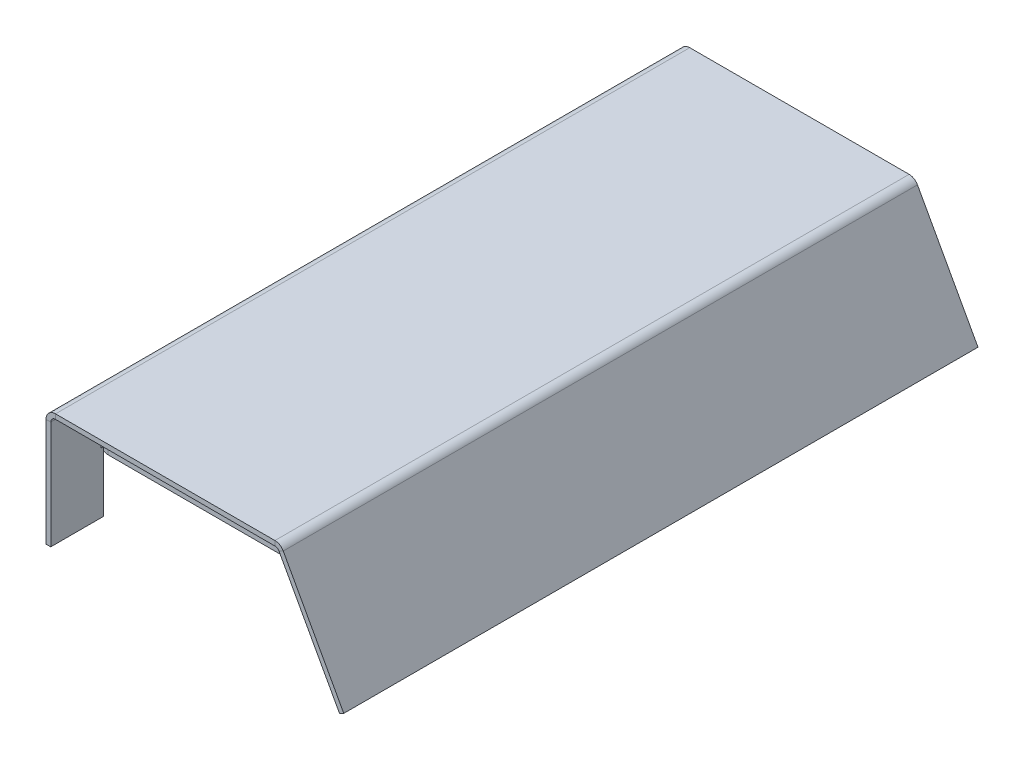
ISO-10303-21;
HEADER;
FILE_DESCRIPTION(('STEP AP214'),'2;1');
FILE_NAME('part.step','',(''),(''),'','','');
FILE_SCHEMA(('AUTOMOTIVE_DESIGN { 1 0 10303 214 1 1 1 1 }'));
ENDSEC;
DATA;
#1=APPLICATION_CONTEXT('core data for automotive mechanical design processes');
#2=APPLICATION_PROTOCOL_DEFINITION('international standard','automotive_design',2000,#1);
#3=PRODUCT_CONTEXT('',#1,'mechanical');
#4=PRODUCT('Part','Part','',(#3));
#5=PRODUCT_RELATED_PRODUCT_CATEGORY('part','',(#4));
#6=PRODUCT_DEFINITION_FORMATION('','',#4);
#7=PRODUCT_DEFINITION_CONTEXT('part definition',#1,'design');
#8=PRODUCT_DEFINITION('design','',#6,#7);
#9=PRODUCT_DEFINITION_SHAPE('','',#8);
#10=(LENGTH_UNIT() NAMED_UNIT(*) SI_UNIT(.MILLI.,.METRE.));
#11=(NAMED_UNIT(*) PLANE_ANGLE_UNIT() SI_UNIT($,.RADIAN.));
#12=(NAMED_UNIT(*) SI_UNIT($,.STERADIAN.) SOLID_ANGLE_UNIT());
#13=UNCERTAINTY_MEASURE_WITH_UNIT(LENGTH_MEASURE(1.E-05),#10,'distance_accuracy_value','');
#14=(GEOMETRIC_REPRESENTATION_CONTEXT(3) GLOBAL_UNCERTAINTY_ASSIGNED_CONTEXT((#13)) GLOBAL_UNIT_ASSIGNED_CONTEXT((#10,
#11,#12)) REPRESENTATION_CONTEXT('',''));
#15=CARTESIAN_POINT('',(0.,0.,0.));
#16=DIRECTION('',(0.,0.,1.));
#17=DIRECTION('',(1.,0.,0.));
#18=AXIS2_PLACEMENT_3D('',#15,#16,#17);
#19=CARTESIAN_POINT('',(-89.5814787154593,20.577072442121,183.41064428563));
#20=DIRECTION('',(0.,0.,1.));
#21=DIRECTION('',(1.,0.,0.));
#22=AXIS2_PLACEMENT_3D('',#19,#20,#21);
#23=PLANE('',#22);
#24=DIRECTION('',(0.,-1.,0.));
#25=VECTOR('',#24,1.);
#26=CARTESIAN_POINT('',(-89.5814787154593,19.077072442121,183.41064428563));
#27=LINE('',#26,#25);
#28=CARTESIAN_POINT('',(-89.5814787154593,19.077072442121,183.41064428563));
#29=VERTEX_POINT('',#28);
#30=CARTESIAN_POINT('',(-89.5814787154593,17.577072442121,183.41064428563));
#31=VERTEX_POINT('',#30);
#32=EDGE_CURVE('E835',#29,#31,#27,.T.);
#33=ORIENTED_EDGE('',*,*,#32,.F.);
#34=CARTESIAN_POINT('',(-89.5814787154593,20.577072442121,183.41064428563));
#35=DIRECTION('',(0.,0.,-1.));
#36=DIRECTION('',(-1.,0.,0.));
#37=AXIS2_PLACEMENT_3D('',#34,#35,#36);
#38=CIRCLE('',#37,1.49999999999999);
#39=CARTESIAN_POINT('',(-91.0814787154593,20.577072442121,183.41064428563));
#40=VERTEX_POINT('',#39);
#41=EDGE_CURVE('E802',#40,#29,#38,.F.);
#42=ORIENTED_EDGE('',*,*,#41,.F.);
#43=DIRECTION('',(-1.,0.,0.));
#44=VECTOR('',#43,1.);
#45=CARTESIAN_POINT('',(-91.0814787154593,20.577072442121,183.41064428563));
#46=LINE('',#45,#44);
#47=CARTESIAN_POINT('',(-92.5814787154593,20.577072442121,183.41064428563));
#48=VERTEX_POINT('',#47);
#49=EDGE_CURVE('E11',#40,#48,#46,.T.);
#50=ORIENTED_EDGE('',*,*,#49,.T.);
#51=CARTESIAN_POINT('',(-89.5814787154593,20.577072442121,183.41064428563));
#52=DIRECTION('',(0.,0.,-1.));
#53=DIRECTION('',(-1.,0.,0.));
#54=AXIS2_PLACEMENT_3D('',#51,#52,#53);
#55=CIRCLE('',#54,2.99999999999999);
#56=EDGE_CURVE('E811',#48,#31,#55,.F.);
#57=ORIENTED_EDGE('',*,*,#56,.T.);
#58=EDGE_LOOP('',(#33,#42,#50,#57));
#59=FACE_BOUND('',#58,.T.);
#60=ADVANCED_FACE('F374',(#59),#23,.T.);
#61=CARTESIAN_POINT('',(-89.5814787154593,20.577072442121,28.0181228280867));
#62=DIRECTION('',(0.,0.,1.));
#63=DIRECTION('',(1.,0.,0.));
#64=AXIS2_PLACEMENT_3D('',#61,#62,#63);
#65=PLANE('',#64);
#66=CARTESIAN_POINT('',(-89.5814787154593,20.577072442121,28.0181228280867));
#67=DIRECTION('',(0.,0.,-1.));
#68=DIRECTION('',(-1.,0.,0.));
#69=AXIS2_PLACEMENT_3D('',#66,#67,#68);
#70=CIRCLE('',#69,1.49999999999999);
#71=CARTESIAN_POINT('',(-89.5814787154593,19.077072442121,28.0181228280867));
#72=VERTEX_POINT('',#71);
#73=CARTESIAN_POINT('',(-91.0814787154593,20.577072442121,28.0181228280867));
#74=VERTEX_POINT('',#73);
#75=EDGE_CURVE('E801',#72,#74,#70,.T.);
#76=ORIENTED_EDGE('',*,*,#75,.F.);
#77=DIRECTION('',(0.,-1.,0.));
#78=VECTOR('',#77,1.);
#79=CARTESIAN_POINT('',(-89.5814787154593,19.077072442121,28.0181228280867));
#80=LINE('',#79,#78);
#81=CARTESIAN_POINT('',(-89.5814787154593,17.577072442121,28.0181228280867));
#82=VERTEX_POINT('',#81);
#83=EDGE_CURVE('E819',#72,#82,#80,.T.);
#84=ORIENTED_EDGE('',*,*,#83,.T.);
#85=CARTESIAN_POINT('',(-89.5814787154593,20.577072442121,28.0181228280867));
#86=DIRECTION('',(0.,0.,-1.));
#87=DIRECTION('',(-1.,0.,0.));
#88=AXIS2_PLACEMENT_3D('',#85,#86,#87);
#89=CIRCLE('',#88,2.99999999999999);
#90=CARTESIAN_POINT('',(-92.5814787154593,20.577072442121,28.0181228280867));
#91=VERTEX_POINT('',#90);
#92=EDGE_CURVE('E805',#82,#91,#89,.T.);
#93=ORIENTED_EDGE('',*,*,#92,.T.);
#94=DIRECTION('',(-1.,0.,0.));
#95=VECTOR('',#94,1.);
#96=CARTESIAN_POINT('',(-91.0814787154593,20.577072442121,28.0181228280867));
#97=LINE('',#96,#95);
#98=EDGE_CURVE('E378',#74,#91,#97,.T.);
#99=ORIENTED_EDGE('',*,*,#98,.F.);
#100=EDGE_LOOP('',(#76,#84,#93,#99));
#101=FACE_BOUND('',#100,.T.);
#102=ADVANCED_FACE('F376',(#101),#65,.F.);
#103=CARTESIAN_POINT('',(-89.5814787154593,20.577072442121,28.0181228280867));
#104=DIRECTION('',(0.,0.,-1.));
#105=DIRECTION('',(0.,-1.,0.));
#106=AXIS2_PLACEMENT_3D('',#103,#104,#105);
#107=CYLINDRICAL_SURFACE('',#106,2.99999999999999);
#108=DIRECTION('',(0.,0.,-1.));
#109=VECTOR('',#108,1.);
#110=CARTESIAN_POINT('',(-92.5814787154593,20.577072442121,28.0181228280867));
#111=LINE('',#110,#109);
#112=EDGE_CURVE('E389',#91,#48,#111,.F.);
#113=ORIENTED_EDGE('',*,*,#112,.F.);
#114=ORIENTED_EDGE('',*,*,#92,.F.);
#115=DIRECTION('',(0.,0.,-1.));
#116=VECTOR('',#115,1.);
#117=CARTESIAN_POINT('',(-89.5814787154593,17.577072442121,28.0181228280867));
#118=LINE('',#117,#116);
#119=EDGE_CURVE('E394',#31,#82,#118,.T.);
#120=ORIENTED_EDGE('',*,*,#119,.F.);
#121=ORIENTED_EDGE('',*,*,#56,.F.);
#122=EDGE_LOOP('',(#113,#114,#120,#121));
#123=FACE_BOUND('',#122,.T.);
#124=ADVANCED_FACE('F858',(#123),#107,.T.);
#125=CARTESIAN_POINT('',(-89.5814787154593,20.577072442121,28.0181228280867));
#126=DIRECTION('',(0.,0.,-1.));
#127=DIRECTION('',(0.,-1.,0.));
#128=AXIS2_PLACEMENT_3D('',#125,#126,#127);
#129=CYLINDRICAL_SURFACE('',#128,1.49999999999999);
#130=DIRECTION('',(0.,0.,-1.));
#131=VECTOR('',#130,1.);
#132=CARTESIAN_POINT('',(-91.0814787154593,20.577072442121,28.0181228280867));
#133=LINE('',#132,#131);
#134=EDGE_CURVE('E806',#74,#40,#133,.F.);
#135=ORIENTED_EDGE('',*,*,#134,.T.);
#136=ORIENTED_EDGE('',*,*,#41,.T.);
#137=DIRECTION('',(0.,0.,-1.));
#138=VECTOR('',#137,1.);
#139=CARTESIAN_POINT('',(-89.5814787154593,19.077072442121,183.41064428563));
#140=LINE('',#139,#138);
#141=EDGE_CURVE('E566',#29,#72,#140,.T.);
#142=ORIENTED_EDGE('',*,*,#141,.T.);
#143=ORIENTED_EDGE('',*,*,#75,.T.);
#144=EDGE_LOOP('',(#135,#136,#142,#143));
#145=FACE_BOUND('',#144,.T.);
#146=ADVANCED_FACE('F833',(#145),#129,.F.);
#147=CARTESIAN_POINT('',(-92.5814787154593,35.577072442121,200.));
#148=DIRECTION('',(1.,0.,0.));
#149=DIRECTION('',(0.,1.,0.));
#150=AXIS2_PLACEMENT_3D('',#147,#148,#149);
#151=PLANE('',#150);
#152=DIRECTION('',(0.,0.,1.));
#153=VECTOR('',#152,1.);
#154=CARTESIAN_POINT('',(-92.5814787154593,19.077072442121,200.));
#155=LINE('',#154,#153);
#156=CARTESIAN_POINT('',(-92.5814787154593,19.077072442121,27.2681228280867));
#157=VERTEX_POINT('',#156);
#158=CARTESIAN_POINT('',(-92.5814787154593,19.077072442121,28.0181228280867));
#159=VERTEX_POINT('',#158);
#160=EDGE_CURVE('E638',#157,#159,#155,.T.);
#161=ORIENTED_EDGE('',*,*,#160,.F.);
#162=DIRECTION('',(0.,-1.,0.));
#163=VECTOR('',#162,1.);
#164=CARTESIAN_POINT('',(-92.5814787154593,35.577072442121,27.2681228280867));
#165=LINE('',#164,#163);
#166=CARTESIAN_POINT('',(-92.5814787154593,21.327072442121,27.2681228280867));
#167=VERTEX_POINT('',#166);
#168=EDGE_CURVE('E656',#167,#157,#165,.T.);
#169=ORIENTED_EDGE('',*,*,#168,.F.);
#170=DIRECTION('',(0.,0.,-1.));
#171=VECTOR('',#170,1.);
#172=CARTESIAN_POINT('',(-92.5814787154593,21.327072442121,200.));
#173=LINE('',#172,#171);
#174=CARTESIAN_POINT('',(-92.5814787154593,21.327072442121,28.0181228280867));
#175=VERTEX_POINT('',#174);
#176=EDGE_CURVE('E653',#175,#167,#173,.T.);
#177=ORIENTED_EDGE('',*,*,#176,.F.);
#178=DIRECTION('',(0.,1.,0.));
#179=VECTOR('',#178,1.);
#180=CARTESIAN_POINT('',(-92.5814787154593,35.577072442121,28.0181228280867));
#181=LINE('',#180,#179);
#182=EDGE_CURVE('E650',#91,#175,#181,.T.);
#183=ORIENTED_EDGE('',*,*,#182,.F.);
#184=ORIENTED_EDGE('',*,*,#112,.T.);
#185=DIRECTION('',(0.,-1.,0.));
#186=VECTOR('',#185,1.);
#187=CARTESIAN_POINT('',(-92.5814787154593,35.577072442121,183.41064428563));
#188=LINE('',#187,#186);
#189=CARTESIAN_POINT('',(-92.5814787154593,21.327072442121,183.41064428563));
#190=VERTEX_POINT('',#189);
#191=EDGE_CURVE('E647',#190,#48,#188,.T.);
#192=ORIENTED_EDGE('',*,*,#191,.F.);
#193=DIRECTION('',(0.,0.,-1.));
#194=VECTOR('',#193,1.);
#195=CARTESIAN_POINT('',(-92.5814787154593,21.327072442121,200.));
#196=LINE('',#195,#194);
#197=CARTESIAN_POINT('',(-92.5814787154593,21.327072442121,184.16064428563));
#198=VERTEX_POINT('',#197);
#199=EDGE_CURVE('E644',#198,#190,#196,.T.);
#200=ORIENTED_EDGE('',*,*,#199,.F.);
#201=DIRECTION('',(0.,1.,0.));
#202=VECTOR('',#201,1.);
#203=CARTESIAN_POINT('',(-92.5814787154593,35.577072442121,184.16064428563));
#204=LINE('',#203,#202);
#205=CARTESIAN_POINT('',(-92.5814787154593,19.077072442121,184.16064428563));
#206=VERTEX_POINT('',#205);
#207=EDGE_CURVE('E641',#206,#198,#204,.T.);
#208=ORIENTED_EDGE('',*,*,#207,.F.);
#209=DIRECTION('',(0.,0.,1.));
#210=VECTOR('',#209,1.);
#211=CARTESIAN_POINT('',(-92.5814787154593,19.077072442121,200.));
#212=LINE('',#211,#210);
#213=CARTESIAN_POINT('',(-92.5814787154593,19.077072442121,183.41064428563));
#214=VERTEX_POINT('',#213);
#215=EDGE_CURVE('E597',#214,#206,#212,.T.);
#216=ORIENTED_EDGE('',*,*,#215,.F.);
#217=DIRECTION('',(0.,1.,0.));
#218=VECTOR('',#217,1.);
#219=CARTESIAN_POINT('',(-92.5814787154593,0.,183.41064428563));
#220=LINE('',#219,#218);
#221=CARTESIAN_POINT('',(-92.5814787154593,0.,183.41064428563));
#222=VERTEX_POINT('',#221);
#223=EDGE_CURVE('E661',#222,#214,#220,.T.);
#224=ORIENTED_EDGE('',*,*,#223,.F.);
#225=DIRECTION('',(0.,0.,-1.));
#226=VECTOR('',#225,1.);
#227=CARTESIAN_POINT('',(-92.5814787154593,0.,200.));
#228=LINE('',#227,#226);
#229=CARTESIAN_POINT('',(-92.5814787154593,0.,200.));
#230=VERTEX_POINT('',#229);
#231=EDGE_CURVE('E777',#230,#222,#228,.T.);
#232=ORIENTED_EDGE('',*,*,#231,.F.);
#233=DIRECTION('',(0.,-1.,0.));
#234=VECTOR('',#233,1.);
#235=CARTESIAN_POINT('',(-92.5814787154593,35.577072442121,200.));
#236=LINE('',#235,#234);
#237=CARTESIAN_POINT('',(-92.5814787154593,34.077072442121,200.));
#238=VERTEX_POINT('',#237);
#239=EDGE_CURVE('E709',#238,#230,#236,.T.);
#240=ORIENTED_EDGE('',*,*,#239,.F.);
#241=DIRECTION('',(0.,0.,-1.));
#242=VECTOR('',#241,1.);
#243=CARTESIAN_POINT('',(-92.5814787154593,34.077072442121,200.));
#244=LINE('',#243,#242);
#245=CARTESIAN_POINT('',(-92.5814787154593,34.077072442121,0.));
#246=VERTEX_POINT('',#245);
#247=EDGE_CURVE('E744',#238,#246,#244,.T.);
#248=ORIENTED_EDGE('',*,*,#247,.T.);
#249=DIRECTION('',(0.,-1.,0.));
#250=VECTOR('',#249,1.);
#251=CARTESIAN_POINT('',(-92.5814787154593,35.577072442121,0.));
#252=LINE('',#251,#250);
#253=CARTESIAN_POINT('',(-92.5814787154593,0.,0.));
#254=VERTEX_POINT('',#253);
#255=EDGE_CURVE('E666',#246,#254,#252,.T.);
#256=ORIENTED_EDGE('',*,*,#255,.T.);
#257=CARTESIAN_POINT('',(-92.5814787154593,0.,28.0181228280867));
#258=VERTEX_POINT('',#257);
#259=EDGE_CURVE('E776',#258,#254,#228,.T.);
#260=ORIENTED_EDGE('',*,*,#259,.F.);
#261=DIRECTION('',(0.,-1.,0.));
#262=VECTOR('',#261,1.);
#263=CARTESIAN_POINT('',(-92.5814787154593,0.,28.0181228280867));
#264=LINE('',#263,#262);
#265=EDGE_CURVE('E659',#159,#258,#264,.T.);
#266=ORIENTED_EDGE('',*,*,#265,.F.);
#267=EDGE_LOOP('',(#161,#169,#177,#183,#184,#192,#200,#208,#216,#224,#232,#240,#248,#256,#260,#266));
#268=FACE_BOUND('',#267,.T.);
#269=ADVANCED_FACE('F821',(#268),#151,.F.);
#270=CARTESIAN_POINT('',(-91.0814787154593,35.577072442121,200.));
#271=DIRECTION('',(1.,0.,0.));
#272=DIRECTION('',(0.,1.,0.));
#273=AXIS2_PLACEMENT_3D('',#270,#271,#272);
#274=PLANE('',#273);
#275=DIRECTION('',(0.,1.,0.));
#276=VECTOR('',#275,1.);
#277=CARTESIAN_POINT('',(-91.0814787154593,19.077072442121,27.2681228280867));
#278=LINE('',#277,#276);
#279=CARTESIAN_POINT('',(-91.0814787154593,19.077072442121,27.2681228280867));
#280=VERTEX_POINT('',#279);
#281=CARTESIAN_POINT('',(-91.0814787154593,21.327072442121,27.2681228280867));
#282=VERTEX_POINT('',#281);
#283=EDGE_CURVE('E598',#280,#282,#278,.T.);
#284=ORIENTED_EDGE('',*,*,#283,.F.);
#285=DIRECTION('',(0.,0.,-1.));
#286=VECTOR('',#285,1.);
#287=CARTESIAN_POINT('',(-91.0814787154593,19.077072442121,28.0181228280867));
#288=LINE('',#287,#286);
#289=CARTESIAN_POINT('',(-91.0814787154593,19.077072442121,28.0181228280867));
#290=VERTEX_POINT('',#289);
#291=EDGE_CURVE('E594',#290,#280,#288,.T.);
#292=ORIENTED_EDGE('',*,*,#291,.F.);
#293=DIRECTION('',(0.,1.,0.));
#294=VECTOR('',#293,1.);
#295=CARTESIAN_POINT('',(-91.0814787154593,35.577072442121,28.0181228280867));
#296=LINE('',#295,#294);
#297=CARTESIAN_POINT('',(-91.0814787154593,0.,28.0181228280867));
#298=VERTEX_POINT('',#297);
#299=EDGE_CURVE('E798',#298,#290,#296,.T.);
#300=ORIENTED_EDGE('',*,*,#299,.F.);
#301=DIRECTION('',(0.,0.,-1.));
#302=VECTOR('',#301,1.);
#303=CARTESIAN_POINT('',(-91.0814787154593,0.,200.));
#304=LINE('',#303,#302);
#305=CARTESIAN_POINT('',(-91.0814787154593,0.,0.));
#306=VERTEX_POINT('',#305);
#307=EDGE_CURVE('E772',#298,#306,#304,.T.);
#308=ORIENTED_EDGE('',*,*,#307,.T.);
#309=DIRECTION('',(0.,-1.,0.));
#310=VECTOR('',#309,1.);
#311=CARTESIAN_POINT('',(-91.0814787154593,35.577072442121,0.));
#312=LINE('',#311,#310);
#313=CARTESIAN_POINT('',(-91.0814787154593,34.077072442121,0.));
#314=VERTEX_POINT('',#313);
#315=EDGE_CURVE('E679',#314,#306,#312,.T.);
#316=ORIENTED_EDGE('',*,*,#315,.F.);
#317=DIRECTION('',(0.,0.,-1.));
#318=VECTOR('',#317,1.);
#319=CARTESIAN_POINT('',(-91.0814787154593,34.077072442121,200.));
#320=LINE('',#319,#318);
#321=CARTESIAN_POINT('',(-91.0814787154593,34.077072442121,200.));
#322=VERTEX_POINT('',#321);
#323=EDGE_CURVE('E769',#322,#314,#320,.T.);
#324=ORIENTED_EDGE('',*,*,#323,.F.);
#325=DIRECTION('',(0.,-1.,0.));
#326=VECTOR('',#325,1.);
#327=CARTESIAN_POINT('',(-91.0814787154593,35.577072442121,200.));
#328=LINE('',#327,#326);
#329=CARTESIAN_POINT('',(-91.0814787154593,0.,200.));
#330=VERTEX_POINT('',#329);
#331=EDGE_CURVE('E714',#322,#330,#328,.T.);
#332=ORIENTED_EDGE('',*,*,#331,.T.);
#333=CARTESIAN_POINT('',(-91.0814787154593,0.,183.41064428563));
#334=VERTEX_POINT('',#333);
#335=EDGE_CURVE('E773',#330,#334,#304,.T.);
#336=ORIENTED_EDGE('',*,*,#335,.T.);
#337=DIRECTION('',(0.,-1.,0.));
#338=VECTOR('',#337,1.);
#339=CARTESIAN_POINT('',(-91.0814787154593,35.577072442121,183.41064428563));
#340=LINE('',#339,#338);
#341=CARTESIAN_POINT('',(-91.0814787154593,19.077072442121,183.41064428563));
#342=VERTEX_POINT('',#341);
#343=EDGE_CURVE('E796',#342,#334,#340,.T.);
#344=ORIENTED_EDGE('',*,*,#343,.F.);
#345=DIRECTION('',(0.,0.,-1.));
#346=VECTOR('',#345,1.);
#347=CARTESIAN_POINT('',(-91.0814787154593,19.077072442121,184.16064428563));
#348=LINE('',#347,#346);
#349=CARTESIAN_POINT('',(-91.0814787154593,19.077072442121,184.16064428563));
#350=VERTEX_POINT('',#349);
#351=EDGE_CURVE('E621',#350,#342,#348,.T.);
#352=ORIENTED_EDGE('',*,*,#351,.F.);
#353=DIRECTION('',(0.,-1.,0.));
#354=VECTOR('',#353,1.);
#355=CARTESIAN_POINT('',(-91.0814787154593,21.327072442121,184.16064428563));
#356=LINE('',#355,#354);
#357=CARTESIAN_POINT('',(-91.0814787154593,21.327072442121,184.16064428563));
#358=VERTEX_POINT('',#357);
#359=EDGE_CURVE('E617',#358,#350,#356,.T.);
#360=ORIENTED_EDGE('',*,*,#359,.F.);
#361=DIRECTION('',(0.,0.,1.));
#362=VECTOR('',#361,1.);
#363=CARTESIAN_POINT('',(-91.0814787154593,21.327072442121,183.41064428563));
#364=LINE('',#363,#362);
#365=CARTESIAN_POINT('',(-91.0814787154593,21.327072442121,183.41064428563));
#366=VERTEX_POINT('',#365);
#367=EDGE_CURVE('E613',#366,#358,#364,.T.);
#368=ORIENTED_EDGE('',*,*,#367,.F.);
#369=DIRECTION('',(0.,1.,0.));
#370=VECTOR('',#369,1.);
#371=CARTESIAN_POINT('',(-91.0814787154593,20.577072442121,183.41064428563));
#372=LINE('',#371,#370);
#373=EDGE_CURVE('E610',#40,#366,#372,.T.);
#374=ORIENTED_EDGE('',*,*,#373,.F.);
#375=ORIENTED_EDGE('',*,*,#134,.F.);
#376=DIRECTION('',(0.,-1.,0.));
#377=VECTOR('',#376,1.);
#378=CARTESIAN_POINT('',(-91.0814787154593,21.327072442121,28.0181228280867));
#379=LINE('',#378,#377);
#380=CARTESIAN_POINT('',(-91.0814787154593,21.327072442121,28.0181228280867));
#381=VERTEX_POINT('',#380);
#382=EDGE_CURVE('E606',#381,#74,#379,.T.);
#383=ORIENTED_EDGE('',*,*,#382,.F.);
#384=DIRECTION('',(0.,0.,1.));
#385=VECTOR('',#384,1.);
#386=CARTESIAN_POINT('',(-91.0814787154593,21.327072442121,27.2681228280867));
#387=LINE('',#386,#385);
#388=EDGE_CURVE('E602',#282,#381,#387,.T.);
#389=ORIENTED_EDGE('',*,*,#388,.F.);
#390=EDGE_LOOP('',(#284,#292,#300,#308,#316,#324,#332,#336,#344,#352,#360,#368,#374,#375,#383,#389));
#391=FACE_BOUND('',#390,.T.);
#392=ADVANCED_FACE('F827',(#391),#274,.T.);
#393=CARTESIAN_POINT('',(-91.0814787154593,0.,200.));
#394=DIRECTION('',(0.,-1.,0.));
#395=DIRECTION('',(0.,0.,-1.));
#396=AXIS2_PLACEMENT_3D('',#393,#394,#395);
#397=PLANE('',#396);
#398=DIRECTION('',(-1.,0.,0.));
#399=VECTOR('',#398,1.);
#400=CARTESIAN_POINT('',(-82.5814787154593,0.,28.0181228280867));
#401=LINE('',#400,#399);
#402=EDGE_CURVE('E663',#298,#258,#401,.T.);
#403=ORIENTED_EDGE('',*,*,#402,.T.);
#404=ORIENTED_EDGE('',*,*,#259,.T.);
#405=DIRECTION('',(-1.,0.,0.));
#406=VECTOR('',#405,1.);
#407=CARTESIAN_POINT('',(-91.0814787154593,0.,0.));
#408=LINE('',#407,#406);
#409=EDGE_CURVE('E676',#306,#254,#408,.T.);
#410=ORIENTED_EDGE('',*,*,#409,.F.);
#411=ORIENTED_EDGE('',*,*,#307,.F.);
#412=EDGE_LOOP('',(#403,#404,#410,#411));
#413=FACE_BOUND('',#412,.T.);
#414=ADVANCED_FACE('F873',(#413),#397,.T.);
#415=CARTESIAN_POINT('',(-20.3981690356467,35.577072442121,200.));
#416=DIRECTION('',(0.,0.,1.));
#417=DIRECTION('',(1.,0.,0.));
#418=AXIS2_PLACEMENT_3D('',#415,#416,#417);
#419=PLANE('',#418);
#420=DIRECTION('',(0.,1.,0.));
#421=VECTOR('',#420,1.);
#422=CARTESIAN_POINT('',(-20.3981690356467,35.577072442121,200.));
#423=LINE('',#422,#421);
#424=CARTESIAN_POINT('',(-20.3981690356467,35.577072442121,200.));
#425=VERTEX_POINT('',#424);
#426=CARTESIAN_POINT('',(-20.3981690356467,37.077072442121,200.));
#427=VERTEX_POINT('',#426);
#428=EDGE_CURVE('E794',#425,#427,#423,.T.);
#429=ORIENTED_EDGE('',*,*,#428,.F.);
#430=CARTESIAN_POINT('',(-20.3981690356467,34.077072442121,200.));
#431=DIRECTION('',(0.,0.,-1.));
#432=DIRECTION('',(-1.,0.,0.));
#433=AXIS2_PLACEMENT_3D('',#430,#431,#432);
#434=CIRCLE('',#433,1.5);
#435=CARTESIAN_POINT('',(-19.0829504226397,34.7983213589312,200.));
#436=VERTEX_POINT('',#435);
#437=EDGE_CURVE('E723',#436,#425,#434,.F.);
#438=ORIENTED_EDGE('',*,*,#437,.F.);
#439=DIRECTION('',(-0.876812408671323,-0.480832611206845,0.));
#440=VECTOR('',#439,1.);
#441=CARTESIAN_POINT('',(-17.7677318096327,35.5195702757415,200.));
#442=LINE('',#441,#440);
#443=CARTESIAN_POINT('',(-17.7677318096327,35.5195702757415,200.));
#444=VERTEX_POINT('',#443);
#445=EDGE_CURVE('E792',#444,#436,#442,.T.);
#446=ORIENTED_EDGE('',*,*,#445,.F.);
#447=CARTESIAN_POINT('',(-20.3981690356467,34.077072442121,200.));
#448=DIRECTION('',(0.,0.,1.));
#449=DIRECTION('',(1.,0.,0.));
#450=AXIS2_PLACEMENT_3D('',#447,#448,#449);
#451=CIRCLE('',#450,3.);
#452=EDGE_CURVE('E735',#444,#427,#451,.T.);
#453=ORIENTED_EDGE('',*,*,#452,.T.);
#454=EDGE_LOOP('',(#429,#438,#446,#453));
#455=FACE_BOUND('',#454,.T.);
#456=ADVANCED_FACE('F869',(#455),#419,.T.);
#457=CARTESIAN_POINT('',(-17.7677318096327,35.5195702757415,200.));
#458=DIRECTION('',(0.,0.,1.));
#459=DIRECTION('',(1.,0.,0.));
#460=AXIS2_PLACEMENT_3D('',#457,#458,#459);
#461=PLANE('',#460);
#462=DIRECTION('',(-1.,0.,0.));
#463=VECTOR('',#462,1.);
#464=CARTESIAN_POINT('',(-19.5100074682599,35.577072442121,200.));
#465=LINE('',#464,#463);
#466=CARTESIAN_POINT('',(-89.5814787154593,35.577072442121,200.));
#467=VERTEX_POINT('',#466);
#468=EDGE_CURVE('E720',#425,#467,#465,.T.);
#469=ORIENTED_EDGE('',*,*,#468,.F.);
#470=ORIENTED_EDGE('',*,*,#428,.T.);
#471=DIRECTION('',(1.,0.,0.));
#472=VECTOR('',#471,1.);
#473=CARTESIAN_POINT('',(-19.5100074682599,37.077072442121,200.));
#474=LINE('',#473,#472);
#475=CARTESIAN_POINT('',(-89.5814787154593,37.077072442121,200.));
#476=VERTEX_POINT('',#475);
#477=EDGE_CURVE('E738',#427,#476,#474,.F.);
#478=ORIENTED_EDGE('',*,*,#477,.T.);
#479=DIRECTION('',(0.,-1.,0.));
#480=VECTOR('',#479,1.);
#481=CARTESIAN_POINT('',(-89.5814787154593,37.077072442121,200.));
#482=LINE('',#481,#480);
#483=EDGE_CURVE('E784',#476,#467,#482,.T.);
#484=ORIENTED_EDGE('',*,*,#483,.T.);
#485=EDGE_LOOP('',(#469,#470,#478,#484));
#486=FACE_BOUND('',#485,.T.);
#487=ADVANCED_FACE('F872',(#486),#461,.T.);
#488=CARTESIAN_POINT('',(-19.0829504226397,34.7983213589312,0.));
#489=DIRECTION('',(0.,0.,-1.));
#490=DIRECTION('',(-1.,0.,0.));
#491=AXIS2_PLACEMENT_3D('',#488,#489,#490);
#492=PLANE('',#491);
#493=DIRECTION('',(0.876812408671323,0.480832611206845,0.));
#494=VECTOR('',#493,1.);
#495=CARTESIAN_POINT('',(-19.0829504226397,34.7983213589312,0.));
#496=LINE('',#495,#494);
#497=CARTESIAN_POINT('',(-19.0829504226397,34.7983213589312,0.));
#498=VERTEX_POINT('',#497);
#499=CARTESIAN_POINT('',(-17.7677318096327,35.5195702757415,0.));
#500=VERTEX_POINT('',#499);
#501=EDGE_CURVE('E790',#498,#500,#496,.T.);
#502=ORIENTED_EDGE('',*,*,#501,.F.);
#503=CARTESIAN_POINT('',(-20.3981690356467,34.077072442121,0.));
#504=DIRECTION('',(0.,0.,-1.));
#505=DIRECTION('',(-1.,0.,0.));
#506=AXIS2_PLACEMENT_3D('',#503,#504,#505);
#507=CIRCLE('',#506,1.5);
#508=CARTESIAN_POINT('',(-20.3981690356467,35.577072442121,0.));
#509=VERTEX_POINT('',#508);
#510=EDGE_CURVE('E688',#498,#509,#507,.F.);
#511=ORIENTED_EDGE('',*,*,#510,.T.);
#512=DIRECTION('',(0.,-1.,0.));
#513=VECTOR('',#512,1.);
#514=CARTESIAN_POINT('',(-20.3981690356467,37.077072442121,0.));
#515=LINE('',#514,#513);
#516=CARTESIAN_POINT('',(-20.3981690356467,37.077072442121,0.));
#517=VERTEX_POINT('',#516);
#518=EDGE_CURVE('E788',#517,#509,#515,.T.);
#519=ORIENTED_EDGE('',*,*,#518,.F.);
#520=CARTESIAN_POINT('',(-20.3981690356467,34.077072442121,0.));
#521=DIRECTION('',(0.,0.,1.));
#522=DIRECTION('',(1.,0.,0.));
#523=AXIS2_PLACEMENT_3D('',#520,#521,#522);
#524=CIRCLE('',#523,3.);
#525=EDGE_CURVE('E700',#500,#517,#524,.T.);
#526=ORIENTED_EDGE('',*,*,#525,.F.);
#527=EDGE_LOOP('',(#502,#511,#519,#526));
#528=FACE_BOUND('',#527,.T.);
#529=ADVANCED_FACE('F877',(#528),#492,.T.);
#530=CARTESIAN_POINT('',(-20.3981690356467,37.077072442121,0.));
#531=DIRECTION('',(0.,0.,-1.));
#532=DIRECTION('',(-1.,0.,0.));
#533=AXIS2_PLACEMENT_3D('',#530,#531,#532);
#534=PLANE('',#533);
#535=DIRECTION('',(-0.480832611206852,0.876812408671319,0.));
#536=VECTOR('',#535,1.);
#537=CARTESIAN_POINT('',(0.,0.,0.));
#538=LINE('',#537,#536);
#539=CARTESIAN_POINT('',(0.,0.,0.));
#540=VERTEX_POINT('',#539);
#541=EDGE_CURVE('E691',#540,#498,#538,.T.);
#542=ORIENTED_EDGE('',*,*,#541,.T.);
#543=ORIENTED_EDGE('',*,*,#501,.T.);
#544=DIRECTION('',(-0.480832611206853,0.876812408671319,0.));
#545=VECTOR('',#544,1.);
#546=CARTESIAN_POINT('',(1.31521861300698,0.721248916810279,0.));
#547=LINE('',#546,#545);
#548=CARTESIAN_POINT('',(1.31521861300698,0.721248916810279,0.));
#549=VERTEX_POINT('',#548);
#550=EDGE_CURVE('E697',#549,#500,#547,.T.);
#551=ORIENTED_EDGE('',*,*,#550,.F.);
#552=DIRECTION('',(-0.876812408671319,-0.480832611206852,0.));
#553=VECTOR('',#552,1.);
#554=CARTESIAN_POINT('',(1.31521861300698,0.721248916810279,0.));
#555=LINE('',#554,#553);
#556=EDGE_CURVE('E694',#549,#540,#555,.T.);
#557=ORIENTED_EDGE('',*,*,#556,.T.);
#558=EDGE_LOOP('',(#542,#543,#551,#557));
#559=FACE_BOUND('',#558,.T.);
#560=ADVANCED_FACE('F881',(#559),#534,.T.);
#561=CARTESIAN_POINT('',(-91.0814787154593,34.077072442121,200.));
#562=DIRECTION('',(0.,0.,1.));
#563=DIRECTION('',(1.,0.,0.));
#564=AXIS2_PLACEMENT_3D('',#561,#562,#563);
#565=PLANE('',#564);
#566=DIRECTION('',(-1.,0.,0.));
#567=VECTOR('',#566,1.);
#568=CARTESIAN_POINT('',(-91.0814787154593,34.077072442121,200.));
#569=LINE('',#568,#567);
#570=EDGE_CURVE('E786',#322,#238,#569,.T.);
#571=ORIENTED_EDGE('',*,*,#570,.F.);
#572=CARTESIAN_POINT('',(-89.5814787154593,34.077072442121,200.));
#573=DIRECTION('',(0.,0.,-1.));
#574=DIRECTION('',(-1.,0.,0.));
#575=AXIS2_PLACEMENT_3D('',#572,#573,#574);
#576=CIRCLE('',#575,1.5);
#577=EDGE_CURVE('E717',#467,#322,#576,.F.);
#578=ORIENTED_EDGE('',*,*,#577,.F.);
#579=ORIENTED_EDGE('',*,*,#483,.F.);
#580=CARTESIAN_POINT('',(-89.5814787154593,34.077072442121,200.));
#581=DIRECTION('',(0.,0.,1.));
#582=DIRECTION('',(1.,0.,0.));
#583=AXIS2_PLACEMENT_3D('',#580,#581,#582);
#584=CIRCLE('',#583,3.);
#585=EDGE_CURVE('E741',#476,#238,#584,.T.);
#586=ORIENTED_EDGE('',*,*,#585,.T.);
#587=EDGE_LOOP('',(#571,#578,#579,#586));
#588=FACE_BOUND('',#587,.T.);
#589=ADVANCED_FACE('F885',(#588),#565,.T.);
#590=CARTESIAN_POINT('',(-89.5814787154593,37.077072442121,200.));
#591=DIRECTION('',(0.,0.,1.));
#592=DIRECTION('',(1.,0.,0.));
#593=AXIS2_PLACEMENT_3D('',#590,#591,#592);
#594=PLANE('',#593);
#595=ORIENTED_EDGE('',*,*,#331,.F.);
#596=ORIENTED_EDGE('',*,*,#570,.T.);
#597=ORIENTED_EDGE('',*,*,#239,.T.);
#598=DIRECTION('',(-1.,0.,0.));
#599=VECTOR('',#598,1.);
#600=CARTESIAN_POINT('',(-91.0814787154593,0.,200.));
#601=LINE('',#600,#599);
#602=EDGE_CURVE('E711',#330,#230,#601,.T.);
#603=ORIENTED_EDGE('',*,*,#602,.F.);
#604=EDGE_LOOP('',(#595,#596,#597,#603));
#605=FACE_BOUND('',#604,.T.);
#606=ADVANCED_FACE('F889',(#605),#594,.T.);
#607=CARTESIAN_POINT('',(-89.5814787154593,35.577072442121,0.));
#608=DIRECTION('',(0.,0.,-1.));
#609=DIRECTION('',(-1.,0.,0.));
#610=AXIS2_PLACEMENT_3D('',#607,#608,#609);
#611=PLANE('',#610);
#612=DIRECTION('',(0.,1.,0.));
#613=VECTOR('',#612,1.);
#614=CARTESIAN_POINT('',(-89.5814787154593,35.577072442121,0.));
#615=LINE('',#614,#613);
#616=CARTESIAN_POINT('',(-89.5814787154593,35.577072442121,0.));
#617=VERTEX_POINT('',#616);
#618=CARTESIAN_POINT('',(-89.5814787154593,37.077072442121,0.));
#619=VERTEX_POINT('',#618);
#620=EDGE_CURVE('E782',#617,#619,#615,.T.);
#621=ORIENTED_EDGE('',*,*,#620,.F.);
#622=CARTESIAN_POINT('',(-89.5814787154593,34.077072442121,0.));
#623=DIRECTION('',(0.,0.,-1.));
#624=DIRECTION('',(-1.,0.,0.));
#625=AXIS2_PLACEMENT_3D('',#622,#623,#624);
#626=CIRCLE('',#625,1.5);
#627=EDGE_CURVE('E682',#617,#314,#626,.F.);
#628=ORIENTED_EDGE('',*,*,#627,.T.);
#629=DIRECTION('',(1.,0.,0.));
#630=VECTOR('',#629,1.);
#631=CARTESIAN_POINT('',(-92.5814787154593,34.077072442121,0.));
#632=LINE('',#631,#630);
#633=EDGE_CURVE('E780',#246,#314,#632,.T.);
#634=ORIENTED_EDGE('',*,*,#633,.F.);
#635=CARTESIAN_POINT('',(-89.5814787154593,34.077072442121,0.));
#636=DIRECTION('',(0.,0.,1.));
#637=DIRECTION('',(1.,0.,0.));
#638=AXIS2_PLACEMENT_3D('',#635,#636,#637);
#639=CIRCLE('',#638,3.);
#640=EDGE_CURVE('E706',#619,#246,#639,.T.);
#641=ORIENTED_EDGE('',*,*,#640,.F.);
#642=EDGE_LOOP('',(#621,#628,#634,#641));
#643=FACE_BOUND('',#642,.T.);
#644=ADVANCED_FACE('F893',(#643),#611,.T.);
#645=CARTESIAN_POINT('',(-92.5814787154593,34.077072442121,0.));
#646=DIRECTION('',(0.,0.,-1.));
#647=DIRECTION('',(-1.,0.,0.));
#648=AXIS2_PLACEMENT_3D('',#645,#646,#647);
#649=PLANE('',#648);
#650=DIRECTION('',(-1.,0.,0.));
#651=VECTOR('',#650,1.);
#652=CARTESIAN_POINT('',(-19.5100074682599,35.577072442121,0.));
#653=LINE('',#652,#651);
#654=EDGE_CURVE('E685',#509,#617,#653,.T.);
#655=ORIENTED_EDGE('',*,*,#654,.T.);
#656=ORIENTED_EDGE('',*,*,#620,.T.);
#657=DIRECTION('',(1.,0.,0.));
#658=VECTOR('',#657,1.);
#659=CARTESIAN_POINT('',(-19.5100074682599,37.077072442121,0.));
#660=LINE('',#659,#658);
#661=EDGE_CURVE('E703',#517,#619,#660,.F.);
#662=ORIENTED_EDGE('',*,*,#661,.F.);
#663=ORIENTED_EDGE('',*,*,#518,.T.);
#664=EDGE_LOOP('',(#655,#656,#662,#663));
#665=FACE_BOUND('',#664,.T.);
#666=ADVANCED_FACE('F897',(#665),#649,.T.);
#667=DIRECTION('',(-1.,0.,0.));
#668=VECTOR('',#667,1.);
#669=CARTESIAN_POINT('',(-82.5814787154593,0.,183.41064428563));
#670=LINE('',#669,#668);
#671=EDGE_CURVE('E670',#334,#222,#670,.T.);
#672=ORIENTED_EDGE('',*,*,#671,.F.);
#673=ORIENTED_EDGE('',*,*,#335,.F.);
#674=ORIENTED_EDGE('',*,*,#602,.T.);
#675=ORIENTED_EDGE('',*,*,#231,.T.);
#676=EDGE_LOOP('',(#672,#673,#674,#675));
#677=FACE_BOUND('',#676,.T.);
#678=ADVANCED_FACE('F901',(#677),#397,.T.);
#679=CARTESIAN_POINT('',(-89.5814787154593,34.077072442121,200.));
#680=DIRECTION('',(0.,0.,-1.));
#681=DIRECTION('',(-1.,0.,0.));
#682=AXIS2_PLACEMENT_3D('',#679,#680,#681);
#683=CYLINDRICAL_SURFACE('',#682,1.5);
#684=ORIENTED_EDGE('',*,*,#627,.F.);
#685=DIRECTION('',(0.,0.,-1.));
#686=VECTOR('',#685,1.);
#687=CARTESIAN_POINT('',(-89.5814787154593,35.577072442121,200.));
#688=LINE('',#687,#686);
#689=EDGE_CURVE('E766',#467,#617,#688,.T.);
#690=ORIENTED_EDGE('',*,*,#689,.F.);
#691=ORIENTED_EDGE('',*,*,#577,.T.);
#692=ORIENTED_EDGE('',*,*,#323,.T.);
#693=EDGE_LOOP('',(#684,#690,#691,#692));
#694=FACE_BOUND('',#693,.T.);
#695=ADVANCED_FACE('F907',(#694),#683,.F.);
#696=CARTESIAN_POINT('',(-19.5100074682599,35.577072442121,200.));
#697=DIRECTION('',(0.,-1.,0.));
#698=DIRECTION('',(0.,0.,-1.));
#699=AXIS2_PLACEMENT_3D('',#696,#697,#698);
#700=PLANE('',#699);
#701=ORIENTED_EDGE('',*,*,#654,.F.);
#702=DIRECTION('',(0.,0.,-1.));
#703=VECTOR('',#702,1.);
#704=CARTESIAN_POINT('',(-20.3981690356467,35.577072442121,200.));
#705=LINE('',#704,#703);
#706=EDGE_CURVE('E763',#425,#509,#705,.T.);
#707=ORIENTED_EDGE('',*,*,#706,.F.);
#708=ORIENTED_EDGE('',*,*,#468,.T.);
#709=ORIENTED_EDGE('',*,*,#689,.T.);
#710=EDGE_LOOP('',(#701,#707,#708,#709));
#711=FACE_BOUND('',#710,.T.);
#712=ADVANCED_FACE('F913',(#711),#700,.T.);
#713=CARTESIAN_POINT('',(-20.3981690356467,34.077072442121,200.));
#714=DIRECTION('',(0.,0.,-1.));
#715=DIRECTION('',(-1.,0.,0.));
#716=AXIS2_PLACEMENT_3D('',#713,#714,#715);
#717=CYLINDRICAL_SURFACE('',#716,1.5);
#718=ORIENTED_EDGE('',*,*,#510,.F.);
#719=DIRECTION('',(0.,0.,-1.));
#720=VECTOR('',#719,1.);
#721=CARTESIAN_POINT('',(-19.0829504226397,34.7983213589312,200.));
#722=LINE('',#721,#720);
#723=EDGE_CURVE('E760',#436,#498,#722,.T.);
#724=ORIENTED_EDGE('',*,*,#723,.F.);
#725=ORIENTED_EDGE('',*,*,#437,.T.);
#726=ORIENTED_EDGE('',*,*,#706,.T.);
#727=EDGE_LOOP('',(#718,#724,#725,#726));
#728=FACE_BOUND('',#727,.T.);
#729=ADVANCED_FACE('F917',(#728),#717,.F.);
#730=CARTESIAN_POINT('',(0.,0.,200.));
#731=DIRECTION('',(-0.876812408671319,-0.480832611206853,0.));
#732=DIRECTION('',(0.480832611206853,-0.876812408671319,0.));
#733=AXIS2_PLACEMENT_3D('',#730,#731,#732);
#734=PLANE('',#733);
#735=ORIENTED_EDGE('',*,*,#541,.F.);
#736=DIRECTION('',(0.,0.,-1.));
#737=VECTOR('',#736,1.);
#738=CARTESIAN_POINT('',(0.,0.,200.));
#739=LINE('',#738,#737);
#740=CARTESIAN_POINT('',(0.,0.,200.));
#741=VERTEX_POINT('',#740);
#742=EDGE_CURVE('E758',#741,#540,#739,.T.);
#743=ORIENTED_EDGE('',*,*,#742,.F.);
#744=DIRECTION('',(-0.480832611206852,0.876812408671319,0.));
#745=VECTOR('',#744,1.);
#746=CARTESIAN_POINT('',(0.,0.,200.));
#747=LINE('',#746,#745);
#748=EDGE_CURVE('E726',#741,#436,#747,.T.);
#749=ORIENTED_EDGE('',*,*,#748,.T.);
#750=ORIENTED_EDGE('',*,*,#723,.T.);
#751=EDGE_LOOP('',(#735,#743,#749,#750));
#752=FACE_BOUND('',#751,.T.);
#753=ADVANCED_FACE('F921',(#752),#734,.T.);
#754=CARTESIAN_POINT('',(1.31521861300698,0.721248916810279,200.));
#755=DIRECTION('',(0.480832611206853,-0.876812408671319,0.));
#756=DIRECTION('',(0.876812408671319,0.480832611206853,0.));
#757=AXIS2_PLACEMENT_3D('',#754,#755,#756);
#758=PLANE('',#757);
#759=ORIENTED_EDGE('',*,*,#556,.F.);
#760=DIRECTION('',(0.,0.,-1.));
#761=VECTOR('',#760,1.);
#762=CARTESIAN_POINT('',(1.31521861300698,0.721248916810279,200.));
#763=LINE('',#762,#761);
#764=CARTESIAN_POINT('',(1.31521861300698,0.721248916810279,200.));
#765=VERTEX_POINT('',#764);
#766=EDGE_CURVE('E756',#765,#549,#763,.T.);
#767=ORIENTED_EDGE('',*,*,#766,.F.);
#768=DIRECTION('',(-0.876812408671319,-0.480832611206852,0.));
#769=VECTOR('',#768,1.);
#770=CARTESIAN_POINT('',(1.31521861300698,0.721248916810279,200.));
#771=LINE('',#770,#769);
#772=EDGE_CURVE('E729',#765,#741,#771,.T.);
#773=ORIENTED_EDGE('',*,*,#772,.T.);
#774=ORIENTED_EDGE('',*,*,#742,.T.);
#775=EDGE_LOOP('',(#759,#767,#773,#774));
#776=FACE_BOUND('',#775,.T.);
#777=ADVANCED_FACE('F925',(#776),#758,.T.);
#778=CARTESIAN_POINT('',(1.31521861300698,0.721248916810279,200.));
#779=DIRECTION('',(-0.876812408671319,-0.480832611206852,0.));
#780=DIRECTION('',(0.480832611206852,-0.876812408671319,0.));
#781=AXIS2_PLACEMENT_3D('',#778,#779,#780);
#782=PLANE('',#781);
#783=ORIENTED_EDGE('',*,*,#550,.T.);
#784=DIRECTION('',(0.,0.,-1.));
#785=VECTOR('',#784,1.);
#786=CARTESIAN_POINT('',(-17.7677318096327,35.5195702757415,200.));
#787=LINE('',#786,#785);
#788=EDGE_CURVE('E753',#444,#500,#787,.T.);
#789=ORIENTED_EDGE('',*,*,#788,.F.);
#790=DIRECTION('',(-0.480832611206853,0.876812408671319,0.));
#791=VECTOR('',#790,1.);
#792=CARTESIAN_POINT('',(1.31521861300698,0.721248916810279,200.));
#793=LINE('',#792,#791);
#794=EDGE_CURVE('E732',#765,#444,#793,.T.);
#795=ORIENTED_EDGE('',*,*,#794,.F.);
#796=ORIENTED_EDGE('',*,*,#766,.T.);
#797=EDGE_LOOP('',(#783,#789,#795,#796));
#798=FACE_BOUND('',#797,.T.);
#799=ADVANCED_FACE('F929',(#798),#782,.F.);
#800=CARTESIAN_POINT('',(-20.3981690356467,34.077072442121,200.));
#801=DIRECTION('',(0.,0.,-1.));
#802=DIRECTION('',(-1.,0.,0.));
#803=AXIS2_PLACEMENT_3D('',#800,#801,#802);
#804=CYLINDRICAL_SURFACE('',#803,3.);
#805=ORIENTED_EDGE('',*,*,#525,.T.);
#806=DIRECTION('',(0.,0.,-1.));
#807=VECTOR('',#806,1.);
#808=CARTESIAN_POINT('',(-20.3981690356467,37.077072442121,200.));
#809=LINE('',#808,#807);
#810=EDGE_CURVE('E750',#427,#517,#809,.T.);
#811=ORIENTED_EDGE('',*,*,#810,.F.);
#812=ORIENTED_EDGE('',*,*,#452,.F.);
#813=ORIENTED_EDGE('',*,*,#788,.T.);
#814=EDGE_LOOP('',(#805,#811,#812,#813));
#815=FACE_BOUND('',#814,.T.);
#816=ADVANCED_FACE('F933',(#815),#804,.T.);
#817=CARTESIAN_POINT('',(-19.5100074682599,37.077072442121,200.));
#818=DIRECTION('',(0.,-1.,0.));
#819=DIRECTION('',(0.,0.,-1.));
#820=AXIS2_PLACEMENT_3D('',#817,#818,#819);
#821=PLANE('',#820);
#822=ORIENTED_EDGE('',*,*,#661,.T.);
#823=DIRECTION('',(0.,0.,-1.));
#824=VECTOR('',#823,1.);
#825=CARTESIAN_POINT('',(-89.5814787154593,37.077072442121,200.));
#826=LINE('',#825,#824);
#827=EDGE_CURVE('E747',#476,#619,#826,.T.);
#828=ORIENTED_EDGE('',*,*,#827,.F.);
#829=ORIENTED_EDGE('',*,*,#477,.F.);
#830=ORIENTED_EDGE('',*,*,#810,.T.);
#831=EDGE_LOOP('',(#822,#828,#829,#830));
#832=FACE_BOUND('',#831,.T.);
#833=ADVANCED_FACE('F937',(#832),#821,.F.);
#834=CARTESIAN_POINT('',(-89.5814787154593,34.077072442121,200.));
#835=DIRECTION('',(0.,0.,-1.));
#836=DIRECTION('',(-1.,0.,0.));
#837=AXIS2_PLACEMENT_3D('',#834,#835,#836);
#838=CYLINDRICAL_SURFACE('',#837,3.);
#839=ORIENTED_EDGE('',*,*,#640,.T.);
#840=ORIENTED_EDGE('',*,*,#247,.F.);
#841=ORIENTED_EDGE('',*,*,#585,.F.);
#842=ORIENTED_EDGE('',*,*,#827,.T.);
#843=EDGE_LOOP('',(#839,#840,#841,#842));
#844=FACE_BOUND('',#843,.T.);
#845=ADVANCED_FACE('F941',(#844),#838,.T.);
#846=CARTESIAN_POINT('',(-89.5814787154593,34.077072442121,200.));
#847=DIRECTION('',(0.,0.,-1.));
#848=DIRECTION('',(-1.,0.,0.));
#849=AXIS2_PLACEMENT_3D('',#846,#847,#848);
#850=PLANE('',#849);
#851=ORIENTED_EDGE('',*,*,#794,.T.);
#852=ORIENTED_EDGE('',*,*,#445,.T.);
#853=ORIENTED_EDGE('',*,*,#748,.F.);
#854=ORIENTED_EDGE('',*,*,#772,.F.);
#855=EDGE_LOOP('',(#851,#852,#853,#854));
#856=FACE_BOUND('',#855,.T.);
#857=ADVANCED_FACE('F945',(#856),#850,.F.);
#858=CARTESIAN_POINT('',(-89.5814787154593,34.077072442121,0.));
#859=DIRECTION('',(0.,0.,-1.));
#860=DIRECTION('',(-1.,0.,0.));
#861=AXIS2_PLACEMENT_3D('',#858,#859,#860);
#862=PLANE('',#861);
#863=ORIENTED_EDGE('',*,*,#255,.F.);
#864=ORIENTED_EDGE('',*,*,#633,.T.);
#865=ORIENTED_EDGE('',*,*,#315,.T.);
#866=ORIENTED_EDGE('',*,*,#409,.T.);
#867=EDGE_LOOP('',(#863,#864,#865,#866));
#868=FACE_BOUND('',#867,.T.);
#869=ADVANCED_FACE('F949',(#868),#862,.T.);
#870=CARTESIAN_POINT('',(-82.5814787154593,0.,28.0181228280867));
#871=DIRECTION('',(0.,0.,-1.));
#872=DIRECTION('',(-1.,0.,0.));
#873=AXIS2_PLACEMENT_3D('',#870,#871,#872);
#874=PLANE('',#873);
#875=ORIENTED_EDGE('',*,*,#299,.T.);
#876=DIRECTION('',(-1.,0.,0.));
#877=VECTOR('',#876,1.);
#878=CARTESIAN_POINT('',(-82.5814787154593,19.077072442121,28.0181228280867));
#879=LINE('',#878,#877);
#880=EDGE_CURVE('E664',#290,#159,#879,.T.);
#881=ORIENTED_EDGE('',*,*,#880,.T.);
#882=ORIENTED_EDGE('',*,*,#265,.T.);
#883=ORIENTED_EDGE('',*,*,#402,.F.);
#884=EDGE_LOOP('',(#875,#881,#882,#883));
#885=FACE_BOUND('',#884,.T.);
#886=ADVANCED_FACE('F953',(#885),#874,.F.);
#887=CARTESIAN_POINT('',(-82.5814787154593,0.,183.41064428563));
#888=DIRECTION('',(0.,0.,1.));
#889=DIRECTION('',(1.,0.,0.));
#890=AXIS2_PLACEMENT_3D('',#887,#888,#889);
#891=PLANE('',#890);
#892=ORIENTED_EDGE('',*,*,#343,.T.);
#893=ORIENTED_EDGE('',*,*,#671,.T.);
#894=ORIENTED_EDGE('',*,*,#223,.T.);
#895=DIRECTION('',(-1.,0.,0.));
#896=VECTOR('',#895,1.);
#897=CARTESIAN_POINT('',(-82.5814787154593,19.077072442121,183.41064428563));
#898=LINE('',#897,#896);
#899=EDGE_CURVE('E667',#342,#214,#898,.T.);
#900=ORIENTED_EDGE('',*,*,#899,.F.);
#901=EDGE_LOOP('',(#892,#893,#894,#900));
#902=FACE_BOUND('',#901,.T.);
#903=ADVANCED_FACE('F957',(#902),#891,.F.);
#904=CARTESIAN_POINT('',(-91.0814787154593,19.077072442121,27.2681228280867));
#905=DIRECTION('',(0.,0.,1.));
#906=DIRECTION('',(1.,0.,0.));
#907=AXIS2_PLACEMENT_3D('',#904,#905,#906);
#908=PLANE('',#907);
#909=DIRECTION('',(-1.,0.,0.));
#910=VECTOR('',#909,1.);
#911=CARTESIAN_POINT('',(-91.0814787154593,21.327072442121,27.2681228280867));
#912=LINE('',#911,#910);
#913=EDGE_CURVE('E605',#282,#167,#912,.T.);
#914=ORIENTED_EDGE('',*,*,#913,.T.);
#915=ORIENTED_EDGE('',*,*,#168,.T.);
#916=DIRECTION('',(-1.,0.,0.));
#917=VECTOR('',#916,1.);
#918=CARTESIAN_POINT('',(-91.0814787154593,19.077072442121,27.2681228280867));
#919=LINE('',#918,#917);
#920=EDGE_CURVE('E601',#280,#157,#919,.T.);
#921=ORIENTED_EDGE('',*,*,#920,.F.);
#922=ORIENTED_EDGE('',*,*,#283,.T.);
#923=EDGE_LOOP('',(#914,#915,#921,#922));
#924=FACE_BOUND('',#923,.T.);
#925=ADVANCED_FACE('F961',(#924),#908,.T.);
#926=CARTESIAN_POINT('',(-91.0814787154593,21.327072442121,27.2681228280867));
#927=DIRECTION('',(0.,-1.,0.));
#928=DIRECTION('',(1.,0.,0.));
#929=AXIS2_PLACEMENT_3D('',#926,#927,#928);
#930=PLANE('',#929);
#931=DIRECTION('',(-1.,0.,0.));
#932=VECTOR('',#931,1.);
#933=CARTESIAN_POINT('',(-91.0814787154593,21.327072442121,28.0181228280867));
#934=LINE('',#933,#932);
#935=EDGE_CURVE('E609',#381,#175,#934,.T.);
#936=ORIENTED_EDGE('',*,*,#935,.T.);
#937=ORIENTED_EDGE('',*,*,#176,.T.);
#938=ORIENTED_EDGE('',*,*,#913,.F.);
#939=ORIENTED_EDGE('',*,*,#388,.T.);
#940=EDGE_LOOP('',(#936,#937,#938,#939));
#941=FACE_BOUND('',#940,.T.);
#942=ADVANCED_FACE('F969',(#941),#930,.T.);
#943=CARTESIAN_POINT('',(-91.0814787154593,21.327072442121,28.0181228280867));
#944=DIRECTION('',(0.,0.,-1.));
#945=DIRECTION('',(-1.,0.,0.));
#946=AXIS2_PLACEMENT_3D('',#943,#944,#945);
#947=PLANE('',#946);
#948=ORIENTED_EDGE('',*,*,#98,.T.);
#949=ORIENTED_EDGE('',*,*,#182,.T.);
#950=ORIENTED_EDGE('',*,*,#935,.F.);
#951=ORIENTED_EDGE('',*,*,#382,.T.);
#952=EDGE_LOOP('',(#948,#949,#950,#951));
#953=FACE_BOUND('',#952,.T.);
#954=ADVANCED_FACE('F824',(#953),#947,.T.);
#955=CARTESIAN_POINT('',(-91.0814787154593,20.577072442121,183.41064428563));
#956=DIRECTION('',(0.,0.,1.));
#957=DIRECTION('',(1.,0.,0.));
#958=AXIS2_PLACEMENT_3D('',#955,#956,#957);
#959=PLANE('',#958);
#960=DIRECTION('',(-1.,0.,0.));
#961=VECTOR('',#960,1.);
#962=CARTESIAN_POINT('',(-91.0814787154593,21.327072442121,183.41064428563));
#963=LINE('',#962,#961);
#964=EDGE_CURVE('E616',#366,#190,#963,.T.);
#965=ORIENTED_EDGE('',*,*,#964,.T.);
#966=ORIENTED_EDGE('',*,*,#191,.T.);
#967=ORIENTED_EDGE('',*,*,#49,.F.);
#968=ORIENTED_EDGE('',*,*,#373,.T.);
#969=EDGE_LOOP('',(#965,#966,#967,#968));
#970=FACE_BOUND('',#969,.T.);
#971=ADVANCED_FACE('F976',(#970),#959,.T.);
#972=CARTESIAN_POINT('',(-91.0814787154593,21.327072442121,183.41064428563));
#973=DIRECTION('',(0.,-1.,0.));
#974=DIRECTION('',(1.,0.,0.));
#975=AXIS2_PLACEMENT_3D('',#972,#973,#974);
#976=PLANE('',#975);
#977=DIRECTION('',(-1.,0.,0.));
#978=VECTOR('',#977,1.);
#979=CARTESIAN_POINT('',(-91.0814787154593,21.327072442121,184.16064428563));
#980=LINE('',#979,#978);
#981=EDGE_CURVE('E620',#358,#198,#980,.T.);
#982=ORIENTED_EDGE('',*,*,#981,.T.);
#983=ORIENTED_EDGE('',*,*,#199,.T.);
#984=ORIENTED_EDGE('',*,*,#964,.F.);
#985=ORIENTED_EDGE('',*,*,#367,.T.);
#986=EDGE_LOOP('',(#982,#983,#984,#985));
#987=FACE_BOUND('',#986,.T.);
#988=ADVANCED_FACE('F979',(#987),#976,.T.);
#989=CARTESIAN_POINT('',(-91.0814787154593,21.327072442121,184.16064428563));
#990=DIRECTION('',(0.,0.,-1.));
#991=DIRECTION('',(-1.,0.,0.));
#992=AXIS2_PLACEMENT_3D('',#989,#990,#991);
#993=PLANE('',#992);
#994=DIRECTION('',(-1.,0.,0.));
#995=VECTOR('',#994,1.);
#996=CARTESIAN_POINT('',(-91.0814787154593,19.077072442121,184.16064428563));
#997=LINE('',#996,#995);
#998=EDGE_CURVE('E592',#350,#206,#997,.T.);
#999=ORIENTED_EDGE('',*,*,#998,.T.);
#1000=ORIENTED_EDGE('',*,*,#207,.T.);
#1001=ORIENTED_EDGE('',*,*,#981,.F.);
#1002=ORIENTED_EDGE('',*,*,#359,.T.);
#1003=EDGE_LOOP('',(#999,#1000,#1001,#1002));
#1004=FACE_BOUND('',#1003,.T.);
#1005=ADVANCED_FACE('F965',(#1004),#993,.T.);
#1006=CARTESIAN_POINT('',(-91.0814787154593,19.077072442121,28.0181228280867));
#1007=DIRECTION('',(0.,1.,0.));
#1008=DIRECTION('',(-1.,0.,0.));
#1009=AXIS2_PLACEMENT_3D('',#1006,#1007,#1008);
#1010=PLANE('',#1009);
#1011=ORIENTED_EDGE('',*,*,#920,.T.);
#1012=ORIENTED_EDGE('',*,*,#160,.T.);
#1013=ORIENTED_EDGE('',*,*,#880,.F.);
#1014=ORIENTED_EDGE('',*,*,#291,.T.);
#1015=EDGE_LOOP('',(#1011,#1012,#1013,#1014));
#1016=FACE_BOUND('',#1015,.T.);
#1017=ADVANCED_FACE('F852',(#1016),#1010,.T.);
#1018=CARTESIAN_POINT('',(-91.0814787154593,19.077072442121,184.16064428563));
#1019=DIRECTION('',(0.,1.,0.));
#1020=DIRECTION('',(-1.,0.,0.));
#1021=AXIS2_PLACEMENT_3D('',#1018,#1019,#1020);
#1022=PLANE('',#1021);
#1023=ORIENTED_EDGE('',*,*,#899,.T.);
#1024=ORIENTED_EDGE('',*,*,#215,.T.);
#1025=ORIENTED_EDGE('',*,*,#998,.F.);
#1026=ORIENTED_EDGE('',*,*,#351,.T.);
#1027=EDGE_LOOP('',(#1023,#1024,#1025,#1026));
#1028=FACE_BOUND('',#1027,.T.);
#1029=ADVANCED_FACE('F845',(#1028),#1022,.T.);
#1030=CARTESIAN_POINT('',(-91.0814787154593,17.577072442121,28.0181228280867));
#1031=DIRECTION('',(0.,0.,-1.));
#1032=DIRECTION('',(0.,1.,0.));
#1033=AXIS2_PLACEMENT_3D('',#1030,#1031,#1032);
#1034=PLANE('',#1033);
#1035=DIRECTION('',(-1.,0.,0.));
#1036=VECTOR('',#1035,1.);
#1037=CARTESIAN_POINT('',(-91.0814787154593,17.577072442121,28.0181228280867));
#1038=LINE('',#1037,#1036);
#1039=CARTESIAN_POINT('',(-10.5616203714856,17.5770724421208,28.0181228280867));
#1040=VERTEX_POINT('',#1039);
#1041=EDGE_CURVE('E579',#1040,#82,#1038,.T.);
#1042=ORIENTED_EDGE('',*,*,#1041,.T.);
#1043=ORIENTED_EDGE('',*,*,#83,.F.);
#1044=DIRECTION('',(-1.,0.,0.));
#1045=VECTOR('',#1044,1.);
#1046=CARTESIAN_POINT('',(-91.0814787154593,19.077072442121,28.0181228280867));
#1047=LINE('',#1046,#1045);
#1048=CARTESIAN_POINT('',(-10.5616203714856,19.0770724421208,28.0181228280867));
#1049=VERTEX_POINT('',#1048);
#1050=EDGE_CURVE('E582',#1049,#72,#1047,.T.);
#1051=ORIENTED_EDGE('',*,*,#1050,.F.);
#1052=DIRECTION('',(0.,1.,0.));
#1053=VECTOR('',#1052,1.);
#1054=CARTESIAN_POINT('',(-10.5616203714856,17.5770724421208,28.0181228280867));
#1055=LINE('',#1054,#1053);
#1056=EDGE_CURVE('E578',#1040,#1049,#1055,.T.);
#1057=ORIENTED_EDGE('',*,*,#1056,.F.);
#1058=EDGE_LOOP('',(#1042,#1043,#1051,#1057));
#1059=FACE_BOUND('',#1058,.T.);
#1060=ADVANCED_FACE('F843',(#1059),#1034,.T.);
#1061=CARTESIAN_POINT('',(-10.5616203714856,17.5770724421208,183.41064428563));
#1062=DIRECTION('',(0.,0.,1.));
#1063=DIRECTION('',(0.,-1.,0.));
#1064=AXIS2_PLACEMENT_3D('',#1061,#1062,#1063);
#1065=PLANE('',#1064);
#1066=DIRECTION('',(1.,0.,0.));
#1067=VECTOR('',#1066,1.);
#1068=CARTESIAN_POINT('',(-10.5616203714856,19.0770724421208,183.41064428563));
#1069=LINE('',#1068,#1067);
#1070=CARTESIAN_POINT('',(-10.5616203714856,19.0770724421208,183.41064428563));
#1071=VERTEX_POINT('',#1070);
#1072=EDGE_CURVE('E559',#29,#1071,#1069,.T.);
#1073=ORIENTED_EDGE('',*,*,#1072,.F.);
#1074=ORIENTED_EDGE('',*,*,#32,.T.);
#1075=DIRECTION('',(1.,0.,0.));
#1076=VECTOR('',#1075,1.);
#1077=CARTESIAN_POINT('',(-10.5616203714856,17.5770724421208,183.41064428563));
#1078=LINE('',#1077,#1076);
#1079=CARTESIAN_POINT('',(-10.5616203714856,17.5770724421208,183.41064428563));
#1080=VERTEX_POINT('',#1079);
#1081=EDGE_CURVE('E574',#31,#1080,#1078,.T.);
#1082=ORIENTED_EDGE('',*,*,#1081,.T.);
#1083=DIRECTION('',(0.,1.,0.));
#1084=VECTOR('',#1083,1.);
#1085=CARTESIAN_POINT('',(-10.5616203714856,17.5770724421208,183.41064428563));
#1086=LINE('',#1085,#1084);
#1087=EDGE_CURVE('E571',#1080,#1071,#1086,.T.);
#1088=ORIENTED_EDGE('',*,*,#1087,.T.);
#1089=EDGE_LOOP('',(#1073,#1074,#1082,#1088));
#1090=FACE_BOUND('',#1089,.T.);
#1091=ADVANCED_FACE('F572',(#1090),#1065,.T.);
#1092=CARTESIAN_POINT('',(-91.0814787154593,17.577072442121,28.0181228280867));
#1093=DIRECTION('',(0.,-1.,0.));
#1094=DIRECTION('',(1.,0.,0.));
#1095=AXIS2_PLACEMENT_3D('',#1092,#1093,#1094);
#1096=PLANE('',#1095);
#1097=ORIENTED_EDGE('',*,*,#1081,.F.);
#1098=ORIENTED_EDGE('',*,*,#119,.T.);
#1099=ORIENTED_EDGE('',*,*,#1041,.F.);
#1100=DIRECTION('',(0.,0.,-1.));
#1101=VECTOR('',#1100,1.);
#1102=CARTESIAN_POINT('',(-10.5616203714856,17.5770724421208,28.0181228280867));
#1103=LINE('',#1102,#1101);
#1104=EDGE_CURVE('E588',#1080,#1040,#1103,.T.);
#1105=ORIENTED_EDGE('',*,*,#1104,.F.);
#1106=EDGE_LOOP('',(#1097,#1098,#1099,#1105));
#1107=FACE_BOUND('',#1106,.T.);
#1108=ADVANCED_FACE('F841',(#1107),#1096,.T.);
#1109=CARTESIAN_POINT('',(-91.0814787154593,19.077072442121,28.0181228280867));
#1110=DIRECTION('',(0.,-1.,0.));
#1111=DIRECTION('',(1.,0.,0.));
#1112=AXIS2_PLACEMENT_3D('',#1109,#1110,#1111);
#1113=PLANE('',#1112);
#1114=ORIENTED_EDGE('',*,*,#141,.F.);
#1115=ORIENTED_EDGE('',*,*,#1072,.T.);
#1116=DIRECTION('',(0.,0.,-1.));
#1117=VECTOR('',#1116,1.);
#1118=CARTESIAN_POINT('',(-10.5616203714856,19.0770724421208,28.0181228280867));
#1119=LINE('',#1118,#1117);
#1120=EDGE_CURVE('E564',#1071,#1049,#1119,.T.);
#1121=ORIENTED_EDGE('',*,*,#1120,.T.);
#1122=ORIENTED_EDGE('',*,*,#1050,.T.);
#1123=EDGE_LOOP('',(#1114,#1115,#1121,#1122));
#1124=FACE_BOUND('',#1123,.T.);
#1125=ADVANCED_FACE('F561',(#1124),#1113,.F.);
#1126=CARTESIAN_POINT('',(-10.5616203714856,17.5770724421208,28.0181228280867));
#1127=DIRECTION('',(1.,0.,0.));
#1128=DIRECTION('',(0.,1.,0.));
#1129=AXIS2_PLACEMENT_3D('',#1126,#1127,#1128);
#1130=PLANE('',#1129);
#1131=ORIENTED_EDGE('',*,*,#1120,.F.);
#1132=ORIENTED_EDGE('',*,*,#1087,.F.);
#1133=ORIENTED_EDGE('',*,*,#1104,.T.);
#1134=ORIENTED_EDGE('',*,*,#1056,.T.);
#1135=EDGE_LOOP('',(#1131,#1132,#1133,#1134));
#1136=FACE_BOUND('',#1135,.T.);
#1137=ADVANCED_FACE('F581',(#1136),#1130,.T.);
#1138=CLOSED_SHELL('',(#60,#102,#124,#146,#269,#392,#414,#456,#487,#529,#560,#589,#606,#644,
#666,#678,#695,#712,#729,#753,#777,#799,#816,#833,#845,#857,#869,#886,#903,#925,#942,#954,#971,
#988,#1005,#1017,#1029,#1060,#1091,#1108,#1125,#1137));
#1139=MANIFOLD_SOLID_BREP('B2',#1138);
#1140=ADVANCED_BREP_SHAPE_REPRESENTATION('',(#18,#1139),#14);
#1141=SHAPE_DEFINITION_REPRESENTATION(#9,#1140);
ENDSEC;
END-ISO-10303-21;
